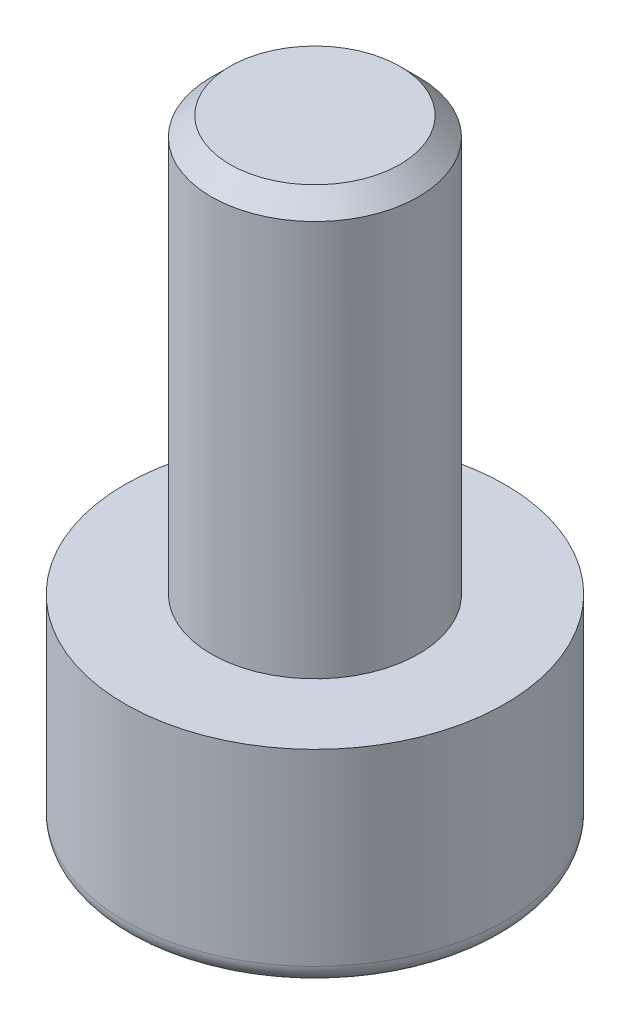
from build123d import *

# Parameters (mm, degrees)
CORTAR_EXTRUIR1_DEPTH = 2
REDONDEO1_R           = 0.28
CHAFL_N1_SIZE         = 0.27


with BuildPart() as part:
    # Croquis1 → Revoluci_n1 (revolve)
    with BuildSketch(Plane.XY, mode=Mode.PRIVATE) as revoluci_n1_sk:
        Polygon((0, 0), (2.75, 0), (2.75, 3), (1.5, 3), (1.5, 9), (0, 9), align=None)
    revolve(revoluci_n1_sk.sketch.rotate(Axis((0, 9, 0), (0, -1, 0)), 180), axis=Axis((0, 9, 0), (0, -1, 0)))

    # Croquis2 → Cortar-Extruir1 (cut)
    with BuildSketch(Plane.XZ):
        Polygon((0.834271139, 1.445), (-0.834271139, 1.445), (-1.668542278, 0), (-0.834271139, -1.445), (0.834271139, -1.445), (1.668542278, 0), align=None)
    extrude(amount=-CORTAR_EXTRUIR1_DEPTH, mode=Mode.SUBTRACT)

    # Redondeo1
    redondeo1_edges = [part.edges().sort_by_distance(p)[0] for p in [
        (2.75, 0, 0),
    ]]
    fillet(redondeo1_edges, radius=REDONDEO1_R)

    # Chafl_n1
    chafl_n1_edges = [part.edges().sort_by_distance(p)[0] for p in [
        (1.5, 9, 0),
    ]]
    chamfer(chafl_n1_edges, length=CHAFL_N1_SIZE)


solid = part.part
